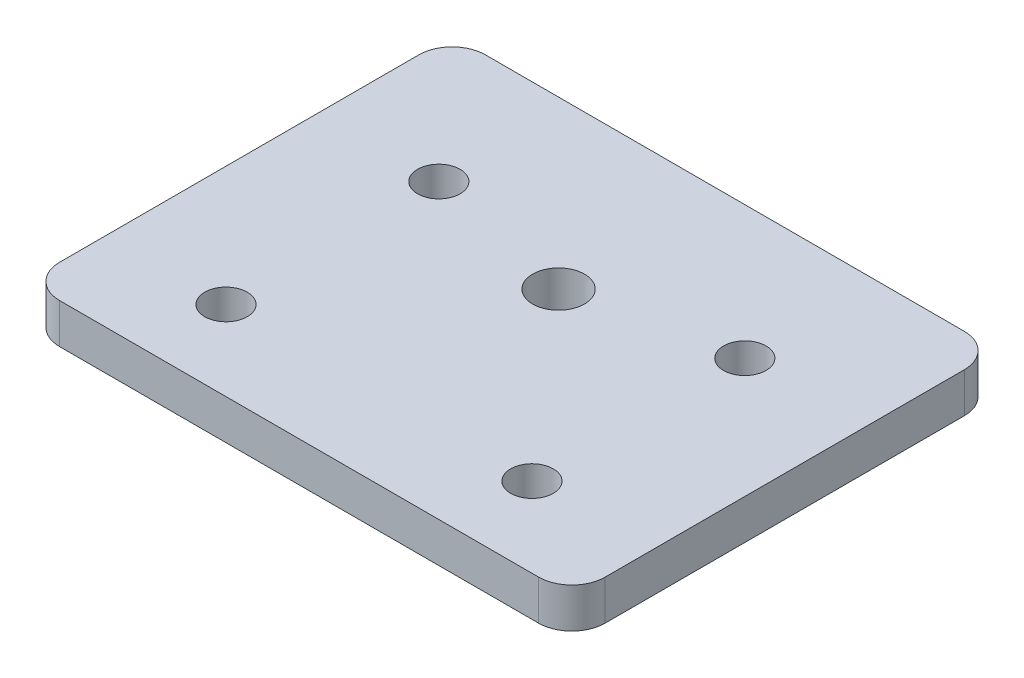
from build123d import *

# Parameters (mm, degrees)
ESQUISSE1_W          = 82
ESQUISSE1_H          = 64
BRUT_RECTANGLE_DEPTH = 6
ESQUISSE3_R          = 3.2
PASSAGES_VIS_DEPTH   = 10
ESQUISSE4_R          = 3.9
AXE_BIELLE_DEPTH     = 10
FILLET1_R            = 5


with BuildPart() as part:
    # Esquisse1 → Brut rectangle (new body)
    with BuildSketch(Plane(origin=(0, 0, 0), x_dir=(1, 0, 0), z_dir=(0, 1, 0))):
        Rectangle(ESQUISSE1_W, ESQUISSE1_H)
    extrude(amount=BRUT_RECTANGLE_DEPTH)

    # Esquisse3 → passages vis (cut)
    with BuildSketch(Plane(origin=(0, 6, 0), x_dir=(-1, 0, 0), z_dir=(0, 1, 0))):
        with Locations(Location((-23, -12, 0), (0, 0, 90))):
            Circle(ESQUISSE3_R)
        with Locations(Location((-23, 20, 0), (0, 0, 90))):
            Circle(ESQUISSE3_R)
        with Locations(Location((23, 20, 0), (0, 0, 90))):
            Circle(ESQUISSE3_R)
        with Locations(Location((23, -12, 0), (0, 0, 90))):
            Circle(ESQUISSE3_R)
    extrude(amount=-PASSAGES_VIS_DEPTH, mode=Mode.SUBTRACT)

    # Esquisse4 → axe bielle (cut)
    with BuildSketch(Plane(origin=(0, 6, 0), x_dir=(-1, 0, 0), z_dir=(0, 1, 0))):
        with Locations(Location((0, -7, 0), (0, 0, 90))):
            Circle(ESQUISSE4_R)
    extrude(amount=-AXE_BIELLE_DEPTH, mode=Mode.SUBTRACT)

    # Fillet1
    fillet1_edges = [part.edges().sort_by_distance(p)[0] for p in [
        (-41, 3, -32),
        (41, 3, -32),
        (41, 3, 32),
        (-41, 3, 32),
    ]]
    fillet(fillet1_edges, radius=FILLET1_R)


solid = part.part
